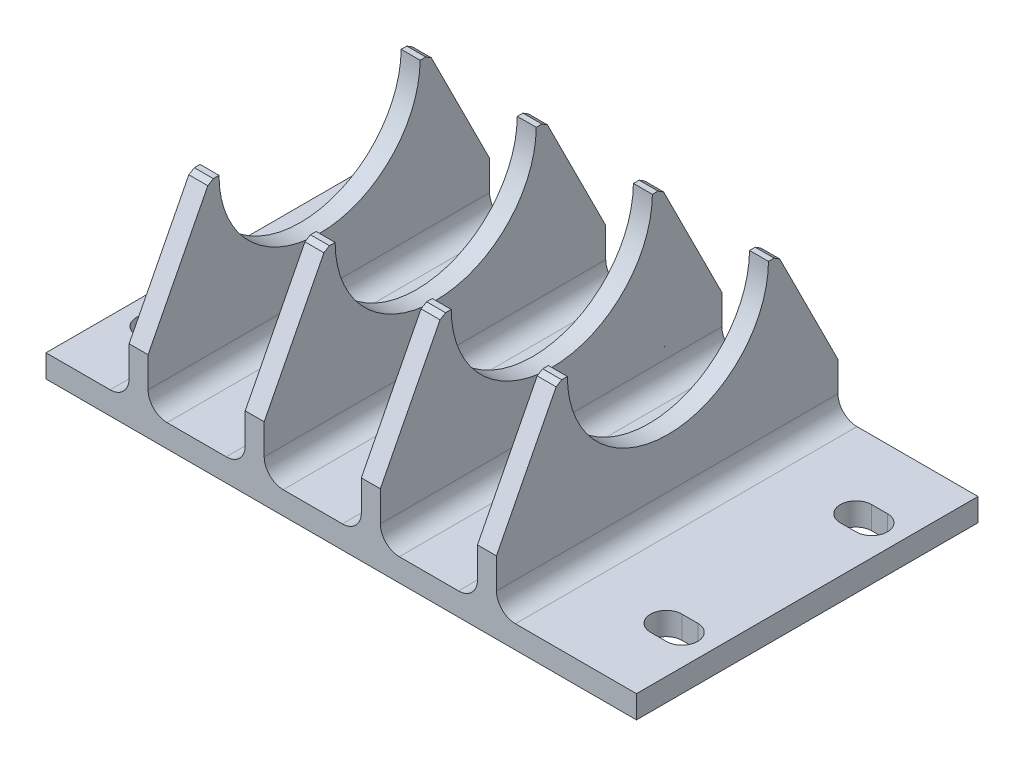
from build123d import *

# Parameters (mm, degrees)
SKETCH1_W           = 155.6
SKETCH1_H           = 90
SKETCH1_R           = 4.15
BOSS_EXTRUDE1_DEPTH = 6
SKETCH4_W           = 5
SKETCH4_H           = 50
BOSS_EXTRUDE2_DEPTH = 90
LPATTERN1_COUNT     = 4
LPATTERN1_PITCH     = 30.6
CUT_EXTRUDE3_DEPTH  = 160
FILLET1_R           = 5
CUT_EXTRUDE4_START  = -10
CUT_EXTRUDE4_DEPTH  = 10
CUT_EXTRUDE5_DEPTH  = 1
CUT_EXTRUDE6_DEPTH  = 1


with BuildPart() as part:
    # Sketch1 → Boss-Extrude1 (new body)
    with BuildSketch(Plane(origin=(0, 0, 0), x_dir=(1, 0, 0), z_dir=(0, 1, 0))):
        Rectangle(SKETCH1_W, SKETCH1_H)
        with Locations(Location((-69.8, 25, 0), (0, 0, 270))):
            Circle(SKETCH1_R, mode=Mode.SUBTRACT)
        with Locations(Location((-69.8, -25, 0), (0, 0, 270))):
            Circle(SKETCH1_R, mode=Mode.SUBTRACT)
        with Locations(Location((69.8, 25, 0), (0, 0, 270))):
            Circle(SKETCH1_R, mode=Mode.SUBTRACT)
        with Locations(Location((69.8, -25, 0), (0, 0, 270))):
            Circle(SKETCH1_R, mode=Mode.SUBTRACT)
    extrude(amount=BOSS_EXTRUDE1_DEPTH)

    # Sketch4 → Boss-Extrude2 (add)
    with BuildSketch(Plane.XY.offset(45)):
        with Locations((38.4, 31)):
            Rectangle(SKETCH4_W, SKETCH4_H)
    boss_extrude2 = extrude(amount=-BOSS_EXTRUDE2_DEPTH)

    # LPattern1: Boss-Extrude2 ×4
    with Locations(*[(-i * LPATTERN1_PITCH, 0, 0) for i in range(1, LPATTERN1_COUNT)]):
        add(boss_extrude2)

    # Sketch5 → Cut-Extrude3 (cut)
    with BuildSketch(Plane.ZY.offset(55.9)):
        with BuildLine():
            Line((26.30668885, 50.587354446), (27.80668885, 50.587354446))
            Line((27.80668885, 50.587354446), (29.262886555, 49.697475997))
            Line((29.262886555, 49.697475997), (45, 19))
            Line((45, 19), (60.820382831, 19))
            Line((60.820382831, 19), (60.820382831, 68.743316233))
            Line((60.820382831, 68.743316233), (-54.748505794, 68.743316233))
            Line((-54.748505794, 68.743316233), (-54.748505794, 18.60931822))
            Line((-54.748505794, 18.60931822), (-45.111030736, 18.60931822))
            Line((-45.111030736, 18.60931822), (-29.640685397, 49.442096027))
            Line((-29.640685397, 49.442096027), (-28.192258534, 50.34456765))
            Line((-28.192258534, 50.34456765), (-26.692314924, 50.357574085))
            ThreePointArc((-26.692314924, 50.357574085), (-0.07841989, 24.087603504), (26.30668885, 50.587354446))
        make_face()
    extrude(amount=-CUT_EXTRUDE3_DEPTH, mode=Mode.SUBTRACT)

    # Fillet1
    fillet1_edges = [part.edges().sort_by_distance(p)[0] for p in [
        (40.9, 6, 0),
        (10.3, 6, 0),
        (-20.3, 6, 0),
        (-50.9, 6, 0),
        (35.9, 6, 0),
        (5.3, 6, 0),
        (-25.3, 6, 0),
        (-55.9, 6, 0),
    ]]
    fillet(fillet1_edges, radius=FILLET1_R)

    # Sketch6 → Cut-Extrude4 (cut)
    with BuildSketch(Plane(origin=(0, 6, 0), x_dir=(1, 0, 0), z_dir=(0, 1, 0)).offset(CUT_EXTRUDE4_START)):
        with BuildLine():
            Line((-69.8, 29.15), (-65.65, 29.15))
            ThreePointArc((-65.65, 29.15), (-61.5, 25), (-65.65, 20.85))
            Line((-65.65, 20.85), (-69.8, 20.85))
            ThreePointArc((-69.8, 20.85), (-73.95, 25), (-69.8, 29.15))
        make_face()
        with BuildLine():
            Line((-69.8, -20.85), (-65.65, -20.85))
            ThreePointArc((-65.65, -20.85), (-61.5, -25), (-65.65, -29.15))
            Line((-65.65, -29.15), (-69.8, -29.15))
            ThreePointArc((-69.8, -29.15), (-73.95, -25), (-69.8, -20.85))
        make_face()
        with BuildLine():
            Line((69.8, 20.85), (65.65, 20.85))
            ThreePointArc((65.65, 20.85), (61.5, 25), (65.65, 29.15))
            Line((65.65, 29.15), (69.8, 29.15))
            ThreePointArc((69.8, 29.15), (73.95, 25), (69.8, 20.85))
        make_face()
        with BuildLine():
            Line((69.8, -29.15), (65.65, -29.15))
            ThreePointArc((65.65, -29.15), (61.5, -25), (65.65, -20.85))
            Line((65.65, -20.85), (69.8, -20.85))
            ThreePointArc((69.8, -20.85), (73.95, -25), (69.8, -29.15))
        make_face()
    extrude(amount=CUT_EXTRUDE4_DEPTH, mode=Mode.SUBTRACT)

    # Sketch7 → Cut-Extrude5 (cut)
    with BuildSketch(Plane(origin=(0, 0, 0), x_dir=(-1, 0, 0), z_dir=(0, -1, 0))):
        with BuildLine():
            ThreePointArc((66.302470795, -10.211702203), (0, -29.024730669), (-66.302470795, -10.211702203))
            ThreePointArc((-66.302470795, -10.211702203), (-72, 0), (-66.302470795, 10.211702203))
            ThreePointArc((-66.302470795, 10.211702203), (0, 29.024730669), (66.302470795, 10.211702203))
            ThreePointArc((66.302470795, 10.211702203), (72, 0), (66.302470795, -10.211702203))
        make_face()
        with BuildLine():
            ThreePointArc((65.252058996, -8.509751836), (70, 0), (65.252058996, 8.509751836))
            ThreePointArc((65.252058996, 8.509751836), (0, 27.024730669), (-65.252058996, 8.509751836))
            ThreePointArc((-65.252058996, 8.509751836), (-70, 0), (-65.252058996, -8.509751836))
            ThreePointArc((-65.252058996, -8.509751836), (0, -27.024730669), (65.252058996, -8.509751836))
        make_face(mode=Mode.SUBTRACT)
    extrude(amount=-CUT_EXTRUDE5_DEPTH, mode=Mode.SUBTRACT)

    # Sketch9 → Cut-Extrude6 (cut)
    # profile 1 of 10: a face of its own
    with BuildSketch(Plane.XZ):
        with BuildLine():
            Line((-42.683079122, 8.459761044), (-44.412386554, 5.824625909))
            Line((-44.412386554, 5.824625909), (-48.390427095, 5.824625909))
            Line((-48.390427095, 5.824625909), (-49.974041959, 0.757058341))
            Line((-49.974041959, 0.757058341), (-46.33172777, 0.757058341))
            add(Edge.make_bspline(
                [(-46.33172777, 0.757058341), (-46.349100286, 0.632471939), (-46.382432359, 0.393432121), (-46.507803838, 0.063329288), (-46.692489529, -0.216232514), (-46.933473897, -0.446985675), (-47.231942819, -0.626617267), (-47.587694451, -0.75063428), (-47.996322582, -0.830371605), (-48.287609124, -0.84031842), (-48.44110277, -0.845559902)],
                knots=[0, 0, 0, 0, 1.017887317, 1.952986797, 2.836476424, 3.714638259, 4.636907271, 5.639186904, 6.755967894, 8, 8, 8, 8], degree=3))
            Line((-48.44110277, -0.845559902), (-50.518805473, -0.86456328))
            Line((-50.518805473, -0.86456328), (-51.263104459, -3.407848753))
            add(Edge.make_bspline(
                [(-51.263104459, -3.407848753), (-51.310952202, -3.535257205), (-51.404802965, -3.785162), (-51.573175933, -4.141046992), (-51.762287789, -4.469801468), (-51.959245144, -4.78110071), (-52.183126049, -5.060331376), (-52.416970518, -5.32204376), (-52.675725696, -5.550354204), (-52.944879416, -5.762880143), (-53.234874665, -5.946748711), (-53.542531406, -6.105131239), (-53.868276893, -6.238217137), (-54.209939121, -6.349652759), (-54.569445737, -6.433566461), (-54.944525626, -6.499083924), (-55.338729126, -6.532167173), (-55.607437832, -6.537509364), (-55.744734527, -6.540238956)],
                knots=[0, 0, 0, 0, 1.109261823, 2.17575713, 3.204921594, 4.200459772, 5.175052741, 6.119377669, 7.057918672, 7.984183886, 8.913004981, 9.85229557, 10.801745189, 11.778919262, 12.778912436, 13.809048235, 14.880533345, 16, 16, 16, 16], degree=3))
            Line((-55.744734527, -6.540238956), (-63.358754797, -6.540238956))
            add(Edge.make_bspline(
                [(-63.358754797, -6.540238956), (-63.280946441, -6.365400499), (-63.136326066, -6.040432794), (-62.915778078, -5.598450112), (-62.709120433, -5.238039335), (-62.565070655, -5.032854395), (-62.500435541, -4.940787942)],
                knots=[0, 0, 0, 0, 1.262492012, 2.346561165, 3.258102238, 4, 4, 4, 4], degree=3))
            add(Edge.make_bspline(
                [(-62.500435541, -4.940787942), (-62.446846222, -4.874179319), (-62.343148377, -4.745288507), (-62.169826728, -4.575570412), (-61.989128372, -4.432481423), (-61.801936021, -4.315077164), (-61.609284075, -4.220832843), (-61.408357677, -4.15337774), (-61.199097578, -4.115377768), (-61.057378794, -4.110330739), (-60.98649973, -4.107806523)],
                knots=[0, 0, 0, 0, 1.143544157, 2.212811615, 3.239098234, 4.223266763, 5.165024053, 6.103488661, 7.051481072, 8, 8, 8, 8], degree=3))
            add(Edge.make_bspline(
                [(-60.98649973, -4.107806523), (-60.941062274, -4.108139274), (-60.847899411, -4.108821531), (-60.755247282, -4.118622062), (-60.707783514, -4.123642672)],
                knots=[0, 0, 0, 0, 0.975441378, 2, 2, 2, 2], degree=3))
            Line((-60.707783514, -4.123642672), (-55.510359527, -4.766590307))
            Line((-55.510359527, -4.766590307), (-52.216440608, 5.824625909))
            Line((-52.216440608, 5.824625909), (-58.161330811, 5.824625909))
            add(Edge.make_bspline(
                [(-58.161330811, 5.824625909), (-58.271227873, 5.822184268), (-58.489571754, 5.817333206), (-58.812805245, 5.778714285), (-59.127693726, 5.71377203), (-59.436395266, 5.630736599), (-59.733530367, 5.513982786), (-60.024549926, 5.37909704), (-60.303355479, 5.212366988), (-60.481582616, 5.086754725), (-60.571592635, 5.023316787)],
                knots=[0, 0, 0, 0, 1.020009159, 2.026557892, 3.01641184, 4.003204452, 4.989705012, 5.976108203, 6.977874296, 8, 8, 8, 8], degree=3))
            add(Edge.make_bspline(
                [(-60.571592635, 5.023316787), (-60.663970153, 4.950208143), (-60.844794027, 4.807102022), (-61.083858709, 4.565478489), (-61.282645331, 4.307331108), (-61.452802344, 4.039258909), (-61.576960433, 3.752924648), (-61.671724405, 3.4552445), (-61.725781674, 3.141827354), (-61.733303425, 2.927865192), (-61.737133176, 2.818924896)],
                knots=[0, 0, 0, 0, 1.090341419, 2.134282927, 3.137555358, 4.103449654, 5.066370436, 6.018810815, 6.991263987, 8, 8, 8, 8], degree=3))
            add(Edge.make_bspline(
                [(-61.737133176, 2.818924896), (-61.736106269, 2.746032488), (-61.734182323, 2.609465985), (-61.7152719, 2.416633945), (-61.684142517, 2.247956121), (-61.642140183, 2.102265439), (-61.583952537, 1.981364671), (-61.514711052, 1.88436071), (-61.430635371, 1.810115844), (-61.364383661, 1.783627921), (-61.33172777, 1.770571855)],
                knots=[0, 0, 0, 0, 1.465351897, 2.745388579, 3.890327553, 4.911042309, 5.784494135, 6.57422393, 7.297225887, 8, 8, 8, 8], degree=3))
            add(Edge.make_bspline(
                [(-61.33172777, 1.770571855), (-61.313318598, 1.846025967), (-61.276674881, 1.996218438), (-61.192904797, 2.211083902), (-61.090781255, 2.415525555), (-60.970456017, 2.608900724), (-60.830618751, 2.791620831), (-60.666643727, 2.958589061), (-60.486818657, 3.119593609), (-60.352059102, 3.212047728), (-60.28337473, 3.259169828)],
                knots=[0, 0, 0, 0, 0.996723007, 1.98399116, 2.954349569, 3.92896292, 4.905461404, 5.902922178, 6.931159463, 8, 8, 8, 8], degree=3))
            add(Edge.make_bspline(
                [(-60.28337473, 3.259169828), (-60.148324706, 3.34150474), (-59.878644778, 3.505918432), (-59.431897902, 3.678079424), (-58.955361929, 3.776570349), (-58.628427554, 3.790511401), (-58.462217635, 3.797598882)],
                knots=[0, 0, 0, 0, 0.983662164, 1.964264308, 2.965053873, 4, 4, 4, 4], degree=3))
            add(Edge.make_bspline(
                [(-58.462217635, 3.797598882), (-58.370268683, 3.796110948), (-58.190016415, 3.793194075), (-57.924043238, 3.760112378), (-57.668746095, 3.706887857), (-57.422451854, 3.632385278), (-57.183192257, 3.542401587), (-56.956501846, 3.423922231), (-56.738612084, 3.286680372), (-56.602275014, 3.182143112), (-56.53337473, 3.129313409)],
                knots=[0, 0, 0, 0, 1.058707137, 2.075438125, 3.082007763, 4.059352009, 5.037301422, 6.021808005, 7.000286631, 8, 8, 8, 8], degree=3))
            add(Edge.make_bspline(
                [(-56.53337473, 3.129313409), (-56.463311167, 3.069606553), (-56.326054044, 2.952638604), (-56.14710018, 2.753122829), (-55.995533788, 2.541623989), (-55.868896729, 2.317274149), (-55.775090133, 2.077875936), (-55.704471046, 1.826688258), (-55.662350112, 1.561901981), (-55.658176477, 1.38115382), (-55.656052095, 1.289152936)],
                knots=[0, 0, 0, 0, 1.044700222, 2.046606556, 3.035000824, 3.995950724, 4.964651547, 5.948086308, 6.955575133, 8, 8, 8, 8], degree=3))
            add(Edge.make_bspline(
                [(-55.656052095, 1.289152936), (-55.659076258, 1.187644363), (-55.665001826, 0.988747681), (-55.711945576, 0.698655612), (-55.796753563, 0.427614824), (-55.906712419, 0.17048277), (-56.054078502, -0.067427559), (-56.232923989, -0.288771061), (-56.447193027, -0.488387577), (-56.607077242, -0.605391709), (-56.688568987, -0.665027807)],
                knots=[0, 0, 0, 0, 1.054946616, 2.067070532, 3.042536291, 4.000812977, 4.966351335, 5.94157014, 6.950834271, 8, 8, 8, 8], degree=3))
            add(Edge.make_bspline(
                [(-56.688568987, -0.665027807), (-56.763811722, -0.713804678), (-56.914755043, -0.811655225), (-57.156942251, -0.936394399), (-57.414264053, -1.034941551), (-57.682006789, -1.122914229), (-57.965033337, -1.188730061), (-58.261437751, -1.235317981), (-58.571417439, -1.264912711), (-58.78203944, -1.268257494), (-58.889793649, -1.269968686)],
                knots=[0, 0, 0, 0, 0.928253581, 1.862155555, 2.814308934, 3.778933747, 4.778667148, 5.819347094, 6.884378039, 8, 8, 8, 8], degree=3))
            add(Edge.make_bspline(
                [(-58.889793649, -1.269968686), (-59.05564006, -1.266768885), (-59.380546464, -1.260500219), (-59.857978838, -1.215965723), (-60.313073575, -1.140493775), (-60.746988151, -1.035293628), (-61.160650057, -0.902750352), (-61.553439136, -0.738888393), (-61.923937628, -0.541400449), (-62.154308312, -0.387213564), (-62.26922777, -0.310298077)],
                knots=[0, 0, 0, 0, 1.114834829, 2.184050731, 3.220153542, 4.213389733, 5.182990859, 6.137301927, 7.070800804, 8, 8, 8, 8], degree=3))
            add(Edge.make_bspline(
                [(-62.26922777, -0.310298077), (-62.389058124, -0.219364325), (-62.623242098, -0.041652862), (-62.924844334, 0.272516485), (-63.188700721, 0.603320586), (-63.397635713, 0.966622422), (-63.565400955, 1.350362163), (-63.676594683, 1.762629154), (-63.754225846, 2.197331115), (-63.760800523, 2.49761549), (-63.764160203, 2.65106172)],
                knots=[0, 0, 0, 0, 1.043366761, 2.039047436, 3.016053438, 3.975731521, 4.941554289, 5.916659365, 6.935406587, 8, 8, 8, 8], degree=3))
            add(Edge.make_bspline(
                [(-63.764160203, 2.65106172), (-63.757714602, 2.880554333), (-63.745109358, 3.329358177), (-63.639374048, 3.982717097), (-63.461397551, 4.596476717), (-63.212010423, 5.170305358), (-62.896838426, 5.70867973), (-62.505493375, 6.2053471), (-62.045454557, 6.664859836), (-61.694105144, 6.928791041), (-61.515427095, 7.063012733)],
                knots=[0, 0, 0, 0, 1.0664305, 2.085549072, 3.067173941, 4.030017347, 4.987101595, 5.959108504, 6.962108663, 8, 8, 8, 8], degree=3))
            add(Edge.make_bspline(
                [(-61.515427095, 7.063012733), (-61.347313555, 7.174827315), (-61.00923058, 7.399690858), (-60.465229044, 7.682622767), (-59.892588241, 7.925191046), (-59.289311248, 8.12062251), (-58.656140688, 8.273456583), (-57.993063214, 8.378509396), (-57.30026221, 8.447993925), (-56.828101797, 8.455785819), (-56.587217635, 8.459761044)],
                knots=[0, 0, 0, 0, 0.930526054, 1.871324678, 2.822583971, 3.795621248, 4.79225737, 5.823170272, 6.889437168, 8, 8, 8, 8], degree=3))
            Line((-56.587217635, 8.459761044), (-42.683079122, 8.459761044))
        make_face()
    # profile 2 of 10: a face of its own
    with BuildSketch(Plane.XZ):
        with BuildLine():
            add(Edge.make_bspline(
                [(-38.629025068, 5.121500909), (-38.631516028, 5.034824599), (-38.636431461, 4.863785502), (-38.673670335, 4.612340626), (-38.743638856, 4.372899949), (-38.829187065, 4.140094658), (-38.950663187, 3.920417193), (-39.091264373, 3.706560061), (-39.265277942, 3.508328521), (-39.456997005, 3.318854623), (-39.666600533, 3.144894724), (-39.894137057, 2.997742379), (-40.126414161, 2.864508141), (-40.374099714, 2.765729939), (-40.6278954, 2.680062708), (-40.894937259, 2.625351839), (-41.172359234, 2.588837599), (-41.361165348, 2.583898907), (-41.457361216, 2.581382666)],
                knots=[0, 0, 0, 0, 0.984503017, 1.942728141, 2.87670971, 3.81430259, 4.753198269, 5.721054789, 6.716091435, 7.742150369, 8.781646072, 9.802717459, 10.817218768, 11.817157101, 12.825901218, 13.856086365, 14.907685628, 16, 16, 16, 16], degree=3))
            add(Edge.make_bspline(
                [(-41.457361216, 2.581382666), (-41.554608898, 2.583908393), (-41.74551152, 2.588866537), (-42.026126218, 2.625259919), (-42.297168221, 2.680604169), (-42.555522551, 2.765156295), (-42.806566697, 2.863799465), (-43.03955915, 2.997803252), (-43.267139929, 3.144874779), (-43.476700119, 3.318872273), (-43.66854515, 3.508279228), (-43.842116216, 3.706732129), (-43.984022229, 3.919390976), (-44.099827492, 4.141762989), (-44.191204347, 4.372019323), (-44.259720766, 4.61248039), (-44.297381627, 4.863749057), (-44.302239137, 5.034812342), (-44.304700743, 5.121500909)],
                knots=[0, 0, 0, 0, 1.099602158, 2.15858036, 3.196066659, 4.223263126, 5.229989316, 6.240179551, 7.256911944, 8.291990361, 9.313689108, 10.304497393, 11.268241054, 12.197563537, 13.135514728, 14.065527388, 15.019680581, 16, 16, 16, 16], degree=3))
            add(Edge.make_bspline(
                [(-44.304700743, 5.121500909), (-44.302273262, 5.207145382), (-44.297483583, 5.376131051), (-44.259185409, 5.625122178), (-44.191972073, 5.863904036), (-44.09885276, 6.092363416), (-43.985074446, 6.313739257), (-43.84098026, 6.523893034), (-43.668700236, 6.722151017), (-43.476666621, 6.911457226), (-43.267114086, 7.085371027), (-43.039692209, 7.23287282), (-42.805710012, 7.365456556), (-42.556940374, 7.470141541), (-42.296417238, 7.548459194), (-42.026247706, 7.605438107), (-41.745479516, 7.641370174), (-41.554598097, 7.646392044), (-41.457361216, 7.648950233)],
                knots=[0, 0, 0, 0, 0.971042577, 1.915970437, 2.848527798, 3.777928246, 4.709793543, 5.666257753, 6.65977709, 7.68427141, 8.72218201, 9.741696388, 10.754650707, 11.76873666, 12.795188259, 13.835513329, 14.897389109, 16, 16, 16, 16], degree=3))
            add(Edge.make_bspline(
                [(-41.457361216, 7.648950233), (-41.36117646, 7.646401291), (-41.172392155, 7.641398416), (-40.894812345, 7.605348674), (-40.628663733, 7.548999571), (-40.372664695, 7.469547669), (-40.127288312, 7.364734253), (-39.893999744, 7.232939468), (-39.666627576, 7.085349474), (-39.457030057, 6.911475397), (-39.265123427, 6.722101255), (-39.09240003, 6.524065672), (-38.949597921, 6.312718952), (-38.830168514, 6.094038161), (-38.742877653, 5.863010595), (-38.67420685, 5.625262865), (-38.63632878, 5.376094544), (-38.631481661, 5.207133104), (-38.629025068, 5.121500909)],
                knots=[0, 0, 0, 0, 1.095321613, 2.149816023, 3.182837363, 4.190706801, 5.198073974, 6.215368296, 7.239250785, 8.281608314, 9.310492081, 10.308268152, 11.268830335, 12.210310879, 13.139267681, 14.075820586, 15.02479699, 16, 16, 16, 16], degree=3))
        make_face()
    # profile 3 of 10: a face of its own
    with BuildSketch(Plane.XZ):
        with BuildLine():
            add(Edge.make_bspline(
                [(-37.615511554, -4.918617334), (-37.640757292, -4.990835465), (-37.690632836, -5.13350979), (-37.784755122, -5.3381605), (-37.903436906, -5.524447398), (-38.037627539, -5.697775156), (-38.189840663, -5.856747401), (-38.362140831, -5.999799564), (-38.553747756, -6.127407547), (-38.691657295, -6.199425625), (-38.762048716, -6.236184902)],
                knots=[0, 0, 0, 0, 1.020280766, 2.015669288, 2.996405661, 3.959800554, 4.935874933, 5.925769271, 6.941276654, 8, 8, 8, 8], degree=3))
            add(Edge.make_bspline(
                [(-38.762048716, -6.236184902), (-38.867681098, -6.283200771), (-39.078769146, -6.377153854), (-39.41554359, -6.470634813), (-39.765006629, -6.529725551), (-40.003358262, -6.536706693), (-40.1239575, -6.540238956)],
                knots=[0, 0, 0, 0, 0.984987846, 1.968327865, 2.97203091, 4, 4, 4, 4], degree=3))
            Line((-40.1239575, -6.540238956), (-44.320536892, -6.540238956))
            add(Edge.make_bspline(
                [(-44.320536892, -6.540238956), (-44.439020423, -6.537204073), (-44.662956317, -6.531468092), (-44.976232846, -6.473307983), (-45.242258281, -6.370704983), (-45.465201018, -6.232098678), (-45.635056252, -6.043235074), (-45.757789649, -5.816896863), (-45.826841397, -5.5485714), (-45.835975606, -5.358205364), (-45.840807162, -5.257510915)],
                knots=[0, 0, 0, 0, 1.249625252, 2.361813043, 3.342508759, 4.24489277, 5.104514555, 5.991917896, 6.937821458, 8, 8, 8, 8], degree=3))
            add(Edge.make_bspline(
                [(-45.840807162, -5.257510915), (-45.833106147, -5.130949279), (-45.816923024, -4.864989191), (-45.734925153, -4.611325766), (-45.691947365, -4.478372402)],
                knots=[0, 0, 0, 0, 0.951734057, 2, 2, 2, 2], degree=3))
            Line((-45.691947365, -4.478372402), (-44.060824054, 0.757058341))
            Line((-44.060824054, 0.757058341), (-40.234810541, 0.757058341))
            Line((-40.234810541, 0.757058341), (-41.992623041, -4.918617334))
            Line((-41.992623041, -4.918617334), (-37.615511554, -4.918617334))
        make_face()
    # profile 4 of 10: a face of its own
    with BuildSketch(Plane.XZ):
        with BuildLine():
            add(Edge.make_bspline(
                [(-29.507403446, -4.918617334), (-29.530814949, -4.991176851), (-29.577457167, -5.135735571), (-29.681026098, -5.337279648), (-29.801405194, -5.525481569), (-29.942703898, -5.699830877), (-30.107741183, -5.856710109), (-30.292849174, -6.000865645), (-30.500646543, -6.128074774), (-30.650080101, -6.199513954), (-30.726786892, -6.236184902)],
                knots=[0, 0, 0, 0, 0.984671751, 1.961739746, 2.92002085, 3.871173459, 4.856223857, 5.858630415, 6.900798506, 8, 8, 8, 8], degree=3))
            add(Edge.make_bspline(
                [(-30.726786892, -6.236184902), (-30.838802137, -6.28322722), (-31.062866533, -6.377326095), (-31.41752484, -6.470224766), (-31.7836639, -6.529779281), (-32.032502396, -6.536725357), (-32.15837473, -6.540238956)],
                knots=[0, 0, 0, 0, 0.987775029, 1.975849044, 2.976104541, 4, 4, 4, 4], degree=3))
            Line((-32.15837473, -6.540238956), (-36.237766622, -6.540238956))
            add(Edge.make_bspline(
                [(-36.237766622, -6.540238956), (-36.360403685, -6.537800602), (-36.591050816, -6.533214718), (-36.913345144, -6.484305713), (-37.187076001, -6.399159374), (-37.415533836, -6.283736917), (-37.593541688, -6.1267864), (-37.720556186, -5.934734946), (-37.795578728, -5.707233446), (-37.804190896, -5.545256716), (-37.808712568, -5.460213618)],
                knots=[0, 0, 0, 0, 1.360301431, 2.55835891, 3.603240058, 4.530866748, 5.377332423, 6.20593436, 7.058056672, 8, 8, 8, 8], degree=3))
            add(Edge.make_bspline(
                [(-37.808712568, -5.460213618), (-37.802973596, -5.360296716), (-37.790630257, -5.145396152), (-37.726068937, -4.939891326), (-37.691525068, -4.829934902)],
                knots=[0, 0, 0, 0, 0.929889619, 2, 2, 2, 2], degree=3))
            Line((-37.691525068, -4.829934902), (-34.188568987, 6.432734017))
            Line((-34.188568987, 6.432734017), (-30.479742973, 6.432734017))
            Line((-30.479742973, 6.432734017), (-33.985866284, -4.918617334))
            Line((-33.985866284, -4.918617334), (-29.507403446, -4.918617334))
        make_face()
    # profile 5 of 10: a face of its own
    with BuildSketch(Plane.XZ):
        with BuildLine():
            add(Edge.make_bspline(
                [(-15.723619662, -4.918617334), (-15.769736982, -5.047387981), (-15.859427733, -5.297826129), (-16.067375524, -5.631358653), (-16.320703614, -5.916636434), (-16.627937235, -6.147798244), (-16.984756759, -6.325465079), (-17.389919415, -6.451417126), (-17.842826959, -6.527333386), (-18.161019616, -6.535813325), (-18.3270825, -6.540238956)],
                knots=[0, 0, 0, 0, 0.98795357, 1.921410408, 2.825387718, 3.736575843, 4.686937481, 5.697463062, 6.798319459, 8, 8, 8, 8], degree=3))
            Line((-18.3270825, -6.540238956), (-22.352631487, -6.540238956))
            add(Edge.make_bspline(
                [(-22.352631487, -6.540238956), (-22.48688857, -6.537612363), (-22.739463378, -6.532671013), (-23.091117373, -6.486239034), (-23.392086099, -6.410948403), (-23.636752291, -6.295051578), (-23.836785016, -6.153823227), (-23.972291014, -5.968222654), (-24.062095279, -5.75402826), (-24.068890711, -5.598430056), (-24.07243723, -5.517223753)],
                knots=[0, 0, 0, 0, 1.430218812, 2.69063824, 3.7743056, 4.720615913, 5.564579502, 6.352278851, 7.140058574, 8, 8, 8, 8], degree=3))
            add(Edge.make_bspline(
                [(-24.07243723, -5.517223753), (-24.169580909, -5.615625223), (-24.36030702, -5.808820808), (-24.678806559, -6.055162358), (-25.007706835, -6.271670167), (-25.35962017, -6.440784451), (-25.724204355, -6.580013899), (-26.107320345, -6.673382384), (-26.506170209, -6.732703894), (-26.77808945, -6.739486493), (-26.916609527, -6.742941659)],
                knots=[0, 0, 0, 0, 1.039362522, 2.040622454, 3.023433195, 3.996920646, 4.972286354, 5.954936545, 6.958211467, 8, 8, 8, 8], degree=3))
            add(Edge.make_bspline(
                [(-26.916609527, -6.742941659), (-27.018060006, -6.74035701), (-27.216293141, -6.735306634), (-27.506877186, -6.700194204), (-27.78298592, -6.640876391), (-28.04350016, -6.554426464), (-28.290290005, -6.44646876), (-28.521311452, -6.31299794), (-28.738981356, -6.156159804), (-28.940320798, -5.977435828), (-29.120746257, -5.776913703), (-29.280459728, -5.561444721), (-29.41347054, -5.329346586), (-29.521635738, -5.082701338), (-29.608028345, -4.822147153), (-29.667362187, -4.546049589), (-29.702470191, -4.25546246), (-29.707521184, -4.057229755), (-29.710106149, -3.955779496)],
                knots=[0, 0, 0, 0, 1.096591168, 2.142727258, 3.159054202, 4.144340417, 5.104993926, 6.06618964, 7.022766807, 8.000888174, 8.970516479, 9.93381036, 10.895006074, 11.855659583, 12.840945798, 13.857272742, 14.903408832, 16, 16, 16, 16], degree=3))
            add(Edge.make_bspline(
                [(-29.710106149, -3.955779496), (-29.705763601, -3.773875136), (-29.697262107, -3.417757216), (-29.615414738, -2.899650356), (-29.486322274, -2.409190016), (-29.30202563, -1.950422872), (-29.068461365, -1.518149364), (-28.778230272, -1.119645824), (-28.437578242, -0.747755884), (-28.176701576, -0.531192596), (-28.044143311, -0.421151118)],
                knots=[0, 0, 0, 0, 1.075724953, 2.10596894, 3.095555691, 4.071220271, 5.024546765, 5.995559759, 6.981491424, 8, 8, 8, 8], degree=3))
            add(Edge.make_bspline(
                [(-28.044143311, -0.421151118), (-27.915886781, -0.326922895), (-27.659435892, -0.138512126), (-27.245435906, 0.101623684), (-26.809980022, 0.305616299), (-26.351323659, 0.469570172), (-25.871909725, 0.600447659), (-25.36860131, 0.691752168), (-24.843258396, 0.745646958), (-24.485359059, 0.753215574), (-24.303645, 0.757058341)],
                knots=[0, 0, 0, 0, 0.95532143, 1.910179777, 2.869009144, 3.839819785, 4.831973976, 5.850583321, 6.908689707, 8, 8, 8, 8], degree=3))
            Line((-24.303645, 0.757058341), (-18.355587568, 0.757058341))
            Line((-18.355587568, 0.757058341), (-20.119734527, -4.918617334))
            Line((-20.119734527, -4.918617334), (-15.723619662, -4.918617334))
        make_face()
        with BuildLine():
            Line((-22.675688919, -0.86456328), (-25.047943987, -0.86456328))
            Line((-25.047943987, -0.86456328), (-25.795410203, -3.430019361))
            add(Edge.make_bspline(
                [(-25.795410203, -3.430019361), (-25.813866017, -3.506721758), (-25.848713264, -3.651546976), (-25.855542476, -3.80029586), (-25.858754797, -3.870264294)],
                knots=[0, 0, 0, 0, 1.059240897, 2, 2, 2, 2], degree=3))
            add(Edge.make_bspline(
                [(-25.858754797, -3.870264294), (-25.852899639, -3.946268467), (-25.841455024, -4.094827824), (-25.743121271, -4.300352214), (-25.583164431, -4.470346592), (-25.361233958, -4.603725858), (-25.081476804, -4.705149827), (-24.742974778, -4.779497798), (-24.344801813, -4.821408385), (-24.059870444, -4.826967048), (-23.907741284, -4.829934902)],
                knots=[0, 0, 0, 0, 0.753168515, 1.472159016, 2.215521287, 3.046160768, 4.023571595, 5.165213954, 6.486464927, 8, 8, 8, 8], degree=3))
            Line((-23.907741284, -4.829934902), (-22.675688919, -0.86456328))
        make_face(mode=Mode.SUBTRACT)
    # profile 6 of 10: a face of its own
    with BuildSketch(Plane.XZ):
        with BuildLine():
            add(Edge.make_bspline(
                [(9.006110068, -4.918617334), (8.964139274, -5.047786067), (8.881830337, -5.301098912), (8.664459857, -5.635187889), (8.390070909, -5.921789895), (8.045635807, -6.151624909), (7.638388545, -6.327201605), (7.169044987, -6.452606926), (6.637316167, -6.527588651), (6.261438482, -6.535878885), (6.063753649, -6.540238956)],
                knots=[0, 0, 0, 0, 0.893188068, 1.751631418, 2.604312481, 3.497364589, 4.464694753, 5.519712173, 6.695545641, 8, 8, 8, 8], degree=3))
            Line((6.063753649, -6.540238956), (2.259910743, -6.540238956))
            add(Edge.make_bspline(
                [(2.259910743, -6.540238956), (2.120424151, -6.5375319), (1.859520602, -6.532468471), (1.495484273, -6.487509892), (1.186811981, -6.40639615), (0.93104111, -6.293552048), (0.727254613, -6.147202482), (0.581292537, -5.963499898), (0.494686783, -5.74384336), (0.484990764, -5.586642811), (0.479927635, -5.504554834)],
                knots=[0, 0, 0, 0, 1.447153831, 2.706837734, 3.796448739, 4.747554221, 5.593324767, 6.373548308, 7.150689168, 8, 8, 8, 8], degree=3))
            add(Edge.make_bspline(
                [(0.479927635, -5.504554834), (0.482297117, -5.438878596), (0.487426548, -5.296703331), (0.537630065, -5.072822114), (0.606325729, -4.820529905), (0.670595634, -4.646830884), (0.704800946, -4.554385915)],
                knots=[0, 0, 0, 0, 0.802173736, 1.736537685, 2.795354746, 4, 4, 4, 4], degree=3))
            Line((0.704800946, -4.554385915), (2.316920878, 0.053933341))
            Line((2.316920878, 0.053933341), (-3.187724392, -5.43487578))
            add(Edge.make_bspline(
                [(-3.187724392, -5.43487578), (-3.251651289, -5.538286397), (-3.373884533, -5.736015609), (-3.573677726, -6.004392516), (-3.77964488, -6.230319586), (-3.989338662, -6.417522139), (-4.205744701, -6.562157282), (-4.427975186, -6.664783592), (-4.654307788, -6.733333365), (-4.808876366, -6.739761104), (-4.885359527, -6.742941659)],
                knots=[0, 0, 0, 0, 1.301069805, 2.487747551, 3.57564923, 4.568655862, 5.490211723, 6.349809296, 7.183457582, 8, 8, 8, 8], degree=3))
            add(Edge.make_bspline(
                [(-4.885359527, -6.742941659), (-4.945615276, -6.74070136), (-5.069640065, -6.73609014), (-5.192668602, -6.719697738), (-5.255925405, -6.711269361)],
                knots=[0, 0, 0, 0, 0.971672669, 2, 2, 2, 2], degree=3))
            add(Edge.make_bspline(
                [(-5.255925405, -6.711269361), (-5.344122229, -6.696942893), (-5.51184384, -6.66969862), (-5.744054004, -6.590525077), (-5.942058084, -6.478999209), (-6.103644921, -6.333607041), (-6.229591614, -6.158570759), (-6.320255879, -5.954103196), (-6.368852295, -5.718991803), (-6.376359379, -5.553329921), (-6.380291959, -5.466548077)],
                knots=[0, 0, 0, 0, 1.144503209, 2.176472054, 3.128704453, 4.039508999, 4.941413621, 5.874882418, 6.886758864, 8, 8, 8, 8], degree=3))
            add(Edge.make_bspline(
                [(-6.380291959, -5.466548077), (-6.377476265, -5.394633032), (-6.371690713, -5.24686551), (-6.335192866, -5.020876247), (-6.275692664, -4.786205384), (-6.217153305, -4.630949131), (-6.187090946, -4.551218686)],
                knots=[0, 0, 0, 0, 0.917351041, 1.884928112, 2.91382396, 4, 4, 4, 4], degree=3))
            Line((-6.187090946, -4.551218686), (-4.080883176, 2.217151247))
            Line((-4.080883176, 2.217151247), (-10.494523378, -5.415872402))
            add(Edge.make_bspline(
                [(-10.494523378, -5.415872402), (-10.546222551, -5.504901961), (-10.646656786, -5.677856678), (-10.829147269, -5.907711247), (-11.029524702, -6.102306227), (-11.247143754, -6.263755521), (-11.48435833, -6.388303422), (-11.739176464, -6.477813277), (-12.012815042, -6.528405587), (-12.200400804, -6.536225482), (-12.296677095, -6.540238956)],
                knots=[0, 0, 0, 0, 1.101622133, 2.140084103, 3.131743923, 4.086212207, 5.03213455, 5.990613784, 6.968705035, 8, 8, 8, 8], degree=3))
            Line((-12.296677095, -6.540238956), (-14.304700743, -6.540238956))
            Line((-14.304700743, -6.540238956), (-10.459683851, 5.824625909))
            Line((-10.459683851, 5.824625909), (-15.926322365, 5.824625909))
            Line((-15.926322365, 5.824625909), (-14.387048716, 8.459761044))
            Line((-14.387048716, 8.459761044), (-7.577504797, 8.459761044))
            add(Edge.make_bspline(
                [(-7.577504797, 8.459761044), (-7.466522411, 8.456753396), (-7.258333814, 8.451111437), (-6.967917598, 8.409524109), (-6.721950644, 8.333264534), (-6.517959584, 8.229853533), (-6.355401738, 8.093968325), (-6.241076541, 7.922709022), (-6.172877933, 7.720374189), (-6.165566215, 7.57559415), (-6.161753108, 7.500090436)],
                knots=[0, 0, 0, 0, 1.374033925, 2.577509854, 3.61927917, 4.548899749, 5.39247498, 6.211802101, 7.067443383, 8, 8, 8, 8], degree=3))
            add(Edge.make_bspline(
                [(-6.161753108, 7.500090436), (-6.164524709, 7.435541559), (-6.170426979, 7.298081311), (-6.210987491, 7.083894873), (-6.275357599, 6.850110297), (-6.333658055, 6.690988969), (-6.364455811, 6.606931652)],
                knots=[0, 0, 0, 0, 0.841357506, 1.791715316, 2.833453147, 4, 4, 4, 4], degree=3))
            Line((-6.364455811, 6.606931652), (-8.457994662, -0.132933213))
            Line((-8.457994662, -0.132933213), (-3.751491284, 5.146838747))
            add(Edge.make_bspline(
                [(-3.751491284, 5.146838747), (-3.688345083, 5.221969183), (-3.56691699, 5.36644257), (-3.388895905, 5.571720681), (-3.226027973, 5.761230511), (-3.067162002, 5.922570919), (-2.925454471, 6.068249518), (-2.791257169, 6.187436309), (-2.671515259, 6.291115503), (-2.591621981, 6.348773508), (-2.554278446, 6.375723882)],
                knots=[0, 0, 0, 0, 1.369292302, 2.633104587, 3.791572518, 4.854204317, 5.79164042, 6.625957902, 7.357748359, 8, 8, 8, 8], degree=3))
            add(Edge.make_bspline(
                [(-2.554278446, 6.375723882), (-2.431834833, 6.447784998), (-2.180163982, 6.595899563), (-1.747486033, 6.737419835), (-1.267683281, 6.823729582), (-0.930961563, 6.833199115), (-0.755291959, 6.838139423)],
                knots=[0, 0, 0, 0, 0.90309895, 1.856231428, 2.881583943, 4, 4, 4, 4], degree=3))
            add(Edge.make_bspline(
                [(-0.755291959, 6.838139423), (-0.702274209, 6.834473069), (-0.5937261, 6.826966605), (-0.428747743, 6.783581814), (-0.261209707, 6.710661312), (-0.15474646, 6.642295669), (-0.099675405, 6.606931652)],
                knots=[0, 0, 0, 0, 0.903088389, 1.848975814, 2.887323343, 4, 4, 4, 4], degree=3))
            add(Edge.make_bspline(
                [(-0.099675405, 6.606931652), (-0.015110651, 6.544830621), (0.150722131, 6.423049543), (0.324372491, 6.164343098), (0.430465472, 5.86535548), (0.442149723, 5.651385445), (0.448255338, 5.539575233)],
                knots=[0, 0, 0, 0, 0.998091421, 1.957272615, 2.93257119, 4, 4, 4, 4], degree=3))
            add(Edge.make_bspline(
                [(0.448255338, 5.539575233), (0.444508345, 5.463421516), (0.436809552, 5.306951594), (0.394274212, 5.064129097), (0.316861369, 4.810740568), (0.248909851, 4.6396157), (0.213880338, 4.551399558)],
                knots=[0, 0, 0, 0, 0.894726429, 1.838357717, 2.885657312, 4, 4, 4, 4], degree=3))
            Line((0.213880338, 4.551399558), (-1.496423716, -0.946911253))
            Line((-1.496423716, -0.946911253), (2.88702223, 3.132480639))
            add(Edge.make_bspline(
                [(2.88702223, 3.132480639), (2.955526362, 3.199114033), (3.0855906, 3.325626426), (3.272109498, 3.503404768), (3.442483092, 3.659125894), (3.590714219, 3.798428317), (3.726086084, 3.911906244), (3.838800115, 4.008864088), (3.937187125, 4.081417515), (3.997546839, 4.121885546), (4.024057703, 4.139659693)],
                knots=[0, 0, 0, 0, 1.508135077, 2.863395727, 4.065967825, 5.150831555, 6.072453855, 6.853197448, 7.496307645, 8, 8, 8, 8], degree=3))
            add(Edge.make_bspline(
                [(4.024057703, 4.139659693), (4.113683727, 4.182869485), (4.304812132, 4.275014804), (4.635740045, 4.354874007), (5.017110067, 4.401982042), (5.288658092, 4.404411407), (5.433474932, 4.40570699)],
                knots=[0, 0, 0, 0, 0.822041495, 1.753011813, 2.801678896, 4, 4, 4, 4], degree=3))
            add(Edge.make_bspline(
                [(5.433474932, 4.40570699), (5.496105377, 4.402772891), (5.624418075, 4.396761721), (5.817560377, 4.341418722), (6.014392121, 4.255804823), (6.140689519, 4.177275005), (6.206278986, 4.136492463)],
                knots=[0, 0, 0, 0, 0.904013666, 1.852077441, 2.884528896, 4, 4, 4, 4], degree=3))
            add(Edge.make_bspline(
                [(6.206278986, 4.136492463), (6.256787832, 4.101782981), (6.354740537, 4.034470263), (6.484896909, 3.915018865), (6.590379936, 3.781701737), (6.683126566, 3.640052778), (6.750970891, 3.484378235), (6.80343865, 3.31803735), (6.831248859, 3.138694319), (6.834754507, 3.015378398), (6.836557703, 2.951948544)],
                knots=[0, 0, 0, 0, 1.046144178, 2.028806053, 3.003325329, 3.943878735, 4.912539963, 5.893711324, 6.916590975, 8, 8, 8, 8], degree=3))
            add(Edge.make_bspline(
                [(6.836557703, 2.951948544), (6.834220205, 2.875749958), (6.829383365, 2.718076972), (6.784221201, 2.476700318), (6.718427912, 2.222320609), (6.656452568, 2.051992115), (6.624353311, 1.963772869)],
                knots=[0, 0, 0, 0, 0.899167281, 1.860590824, 2.891923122, 4, 4, 4, 4], degree=3))
            Line((6.624353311, 1.963772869), (4.214091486, -4.918617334))
            Line((4.214091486, -4.918617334), (9.006110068, -4.918617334))
        make_face()
    # profile 7 of 10: a face of its own
    with BuildSketch(Plane.XZ):
        with BuildLine():
            add(Edge.make_bspline(
                [(22.789893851, -4.918617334), (22.743776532, -5.047387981), (22.65408578, -5.297826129), (22.44613799, -5.631358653), (22.1928099, -5.916636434), (21.885576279, -6.147798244), (21.528756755, -6.325465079), (21.123594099, -6.451417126), (20.670686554, -6.527333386), (20.352493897, -6.535813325), (20.186431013, -6.540238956)],
                knots=[0, 0, 0, 0, 0.98795357, 1.921410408, 2.825387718, 3.736575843, 4.686937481, 5.697463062, 6.798319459, 8, 8, 8, 8], degree=3))
            Line((20.186431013, -6.540238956), (16.160882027, -6.540238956))
            add(Edge.make_bspline(
                [(16.160882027, -6.540238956), (16.026624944, -6.537612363), (15.774050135, -6.532671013), (15.422396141, -6.486239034), (15.121427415, -6.410948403), (14.876761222, -6.295051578), (14.676728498, -6.153823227), (14.541222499, -5.968222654), (14.451418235, -5.75402826), (14.444622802, -5.598430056), (14.441076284, -5.517223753)],
                knots=[0, 0, 0, 0, 1.430218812, 2.69063824, 3.7743056, 4.720615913, 5.564579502, 6.352278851, 7.140058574, 8, 8, 8, 8], degree=3))
            add(Edge.make_bspline(
                [(14.441076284, -5.517223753), (14.343932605, -5.615625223), (14.153206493, -5.808820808), (13.834706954, -6.055162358), (13.505806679, -6.271670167), (13.153893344, -6.440784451), (12.789309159, -6.580013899), (12.406193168, -6.673382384), (12.007343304, -6.732703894), (11.735424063, -6.739486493), (11.596903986, -6.742941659)],
                knots=[0, 0, 0, 0, 1.039362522, 2.040622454, 3.023433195, 3.996920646, 4.972286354, 5.954936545, 6.958211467, 8, 8, 8, 8], degree=3))
            add(Edge.make_bspline(
                [(11.596903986, -6.742941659), (11.495453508, -6.74035701), (11.297220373, -6.735306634), (11.006636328, -6.700194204), (10.730527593, -6.640876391), (10.470013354, -6.554426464), (10.223223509, -6.44646876), (9.992202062, -6.31299794), (9.774532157, -6.156159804), (9.573192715, -5.977435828), (9.392767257, -5.776913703), (9.233053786, -5.561444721), (9.100042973, -5.329346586), (8.991877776, -5.082701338), (8.905485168, -4.822147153), (8.846151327, -4.546049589), (8.811043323, -4.25546246), (8.80599233, -4.057229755), (8.803407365, -3.955779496)],
                knots=[0, 0, 0, 0, 1.096591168, 2.142727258, 3.159054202, 4.144340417, 5.104993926, 6.06618964, 7.022766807, 8.000888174, 8.970516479, 9.93381036, 10.895006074, 11.855659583, 12.840945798, 13.857272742, 14.903408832, 16, 16, 16, 16], degree=3))
            add(Edge.make_bspline(
                [(8.803407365, -3.955779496), (8.807749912, -3.773875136), (8.816251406, -3.417757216), (8.898098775, -2.899650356), (9.02719124, -2.409190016), (9.211487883, -1.950422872), (9.445052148, -1.518149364), (9.735283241, -1.119645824), (10.075935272, -0.747755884), (10.336811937, -0.531192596), (10.469370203, -0.421151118)],
                knots=[0, 0, 0, 0, 1.075724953, 2.10596894, 3.095555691, 4.071220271, 5.024546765, 5.995559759, 6.981491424, 8, 8, 8, 8], degree=3))
            add(Edge.make_bspline(
                [(10.469370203, -0.421151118), (10.597626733, -0.326922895), (10.854077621, -0.138512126), (11.268077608, 0.101623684), (11.703533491, 0.305616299), (12.162189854, 0.469570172), (12.641603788, 0.600447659), (13.144912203, 0.691752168), (13.670255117, 0.745646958), (14.028154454, 0.753215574), (14.209868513, 0.757058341)],
                knots=[0, 0, 0, 0, 0.95532143, 1.910179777, 2.869009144, 3.839819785, 4.831973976, 5.850583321, 6.908689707, 8, 8, 8, 8], degree=3))
            Line((14.209868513, 0.757058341), (20.157925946, 0.757058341))
            Line((20.157925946, 0.757058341), (18.393778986, -4.918617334))
            Line((18.393778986, -4.918617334), (22.789893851, -4.918617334))
        make_face()
        with BuildLine():
            Line((15.837824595, -0.86456328), (13.465569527, -0.86456328))
            Line((13.465569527, -0.86456328), (12.718103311, -3.430019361))
            add(Edge.make_bspline(
                [(12.718103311, -3.430019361), (12.699647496, -3.506721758), (12.664800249, -3.651546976), (12.657971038, -3.80029586), (12.654758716, -3.870264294)],
                knots=[0, 0, 0, 0, 1.059240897, 2, 2, 2, 2], degree=3))
            add(Edge.make_bspline(
                [(12.654758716, -3.870264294), (12.660613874, -3.946268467), (12.67205849, -4.094827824), (12.770392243, -4.300352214), (12.930349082, -4.470346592), (13.152279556, -4.603725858), (13.432036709, -4.705149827), (13.770538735, -4.779497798), (14.1687117, -4.821408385), (14.453643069, -4.826967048), (14.60577223, -4.829934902)],
                knots=[0, 0, 0, 0, 0.753168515, 1.472159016, 2.215521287, 3.046160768, 4.023571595, 5.165213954, 6.486464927, 8, 8, 8, 8], degree=3))
            Line((14.60577223, -4.829934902), (15.837824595, -0.86456328))
        make_face(mode=Mode.SUBTRACT)
    # profile 8 of 10: a face of its own
    with BuildSketch(Plane.XZ):
        with BuildLine():
            add(Edge.make_bspline(
                [(37.587191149, -4.918617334), (37.562443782, -4.991069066), (37.513255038, -5.1350767), (37.410814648, -5.338125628), (37.286818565, -5.526600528), (37.138946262, -5.69888593), (36.971049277, -5.856830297), (36.78210156, -6.001772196), (36.568370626, -6.127945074), (36.414906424, -6.199471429), (36.336135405, -6.236184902)],
                knots=[0, 0, 0, 0, 0.977312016, 1.942540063, 2.896580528, 3.853477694, 4.836359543, 5.837311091, 6.889922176, 8, 8, 8, 8], degree=3))
            add(Edge.make_bspline(
                [(36.336135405, -6.236184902), (36.220931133, -6.283244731), (35.990389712, -6.377418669), (35.627285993, -6.469835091), (35.252854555, -6.530005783), (34.998751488, -6.536792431), (34.869708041, -6.540238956)],
                knots=[0, 0, 0, 0, 0.989144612, 1.979430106, 2.973875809, 4, 4, 4, 4], degree=3))
            Line((34.869708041, -6.540238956), (30.597115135, -6.540238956))
            add(Edge.make_bspline(
                [(30.597115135, -6.540238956), (30.480793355, -6.536500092), (30.262748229, -6.529491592), (29.957043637, -6.480858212), (29.695591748, -6.39435453), (29.481597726, -6.266125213), (29.313135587, -6.103019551), (29.192247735, -5.902996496), (29.121958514, -5.665368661), (29.115221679, -5.49554137), (29.111684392, -5.406370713)],
                knots=[0, 0, 0, 0, 1.310146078, 2.455868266, 3.475111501, 4.392935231, 5.242330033, 6.090808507, 6.997547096, 8, 8, 8, 8], degree=3))
            add(Edge.make_bspline(
                [(29.111684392, -5.406370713), (29.119647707, -5.283019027), (29.1366065, -5.020327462), (29.217588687, -4.769683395), (29.260544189, -4.636733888)],
                knots=[0, 0, 0, 0, 0.93913701, 2, 2, 2, 2], degree=3))
            Line((29.260544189, -4.636733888), (30.175873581, -1.697544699))
            add(Edge.make_bspline(
                [(30.175873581, -1.697544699), (30.151431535, -1.721667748), (30.095635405, -1.776735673), (30.005783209, -1.873767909), (29.88570671, -1.982736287), (29.748270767, -2.11558517), (29.588248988, -2.269145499), (29.406672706, -2.442383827), (29.198583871, -2.632150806), (28.9717511, -2.844597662), (28.721225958, -3.076626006), (28.44597802, -3.324855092), (28.150381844, -3.59514297), (27.835567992, -3.886503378), (27.494534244, -4.19465276), (27.130462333, -4.521897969), (26.749158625, -4.875795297), (26.483284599, -5.113315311), (26.346692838, -5.235340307)],
                knots=[0, 0, 0, 0, 0.316144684, 0.721692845, 1.216718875, 1.80793179, 2.481597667, 3.258487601, 4.118263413, 5.074188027, 6.119653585, 7.261847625, 8.486425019, 9.807130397, 11.210846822, 12.717867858, 14.313817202, 16, 16, 16, 16], degree=3))
            add(Edge.make_bspline(
                [(26.346692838, -5.235340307), (26.217566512, -5.35232102), (25.980131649, -5.567422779), (25.642493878, -5.852175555), (25.356604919, -6.073616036), (25.172528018, -6.18470375), (25.092469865, -6.233017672)],
                knots=[0, 0, 0, 0, 1.302048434, 2.394180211, 3.301601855, 4, 4, 4, 4], degree=3))
            add(Edge.make_bspline(
                [(25.092469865, -6.233017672), (24.995388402, -6.280083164), (24.795974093, -6.376760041), (24.468133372, -6.472318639), (24.111669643, -6.530446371), (23.864883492, -6.53689472), (23.736895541, -6.540238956)],
                knots=[0, 0, 0, 0, 0.920961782, 1.891740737, 2.90661699, 4, 4, 4, 4], degree=3))
            Line((23.736895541, -6.540238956), (22.181785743, -6.540238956))
            Line((22.181785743, -6.540238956), (26.213669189, 6.432734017))
            Line((26.213669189, 6.432734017), (29.989007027, 6.432734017))
            Line((29.989007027, 6.432734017), (27.382376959, -2.03327105))
            Line((27.382376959, -2.03327105), (31.749986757, 2.581382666))
            Line((31.749986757, 2.581382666), (34.261599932, 2.581382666))
            Line((34.261599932, 2.581382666), (31.727816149, 0.148950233))
            Line((31.727816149, 0.148950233), (32.560797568, 0.148950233))
            add(Edge.make_bspline(
                [(32.560797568, 0.148950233), (32.679202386, 0.145281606), (32.902608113, 0.138359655), (33.215752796, 0.088363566), (33.480853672, -0.007246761), (33.700594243, -0.138595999), (33.87392751, -0.309106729), (33.993879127, -0.52201451), (34.068567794, -0.769884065), (34.074693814, -0.948452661), (34.077900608, -1.041928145)],
                knots=[0, 0, 0, 0, 1.291043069, 2.435934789, 3.440994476, 4.345149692, 5.207912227, 6.058845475, 6.98386187, 8, 8, 8, 8], degree=3))
            add(Edge.make_bspline(
                [(34.077900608, -1.041928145), (34.076099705, -1.10749559), (34.072333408, -1.244619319), (34.03843886, -1.456577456), (33.983837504, -1.684050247), (33.933363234, -1.838292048), (33.906870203, -1.91925078)],
                knots=[0, 0, 0, 0, 0.875879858, 1.831761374, 2.86193076, 4, 4, 4, 4], degree=3))
            Line((33.906870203, -1.91925078), (32.972537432, -4.918617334))
            Line((32.972537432, -4.918617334), (37.587191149, -4.918617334))
        make_face()
    # profile 9 of 10: a face of its own
    with BuildSketch(Plane.XZ):
        with BuildLine():
            add(Edge.make_bspline(
                [(50.965569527, -4.918617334), (50.920982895, -5.043470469), (50.831935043, -5.292825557), (50.605798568, -5.627297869), (50.308276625, -5.919561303), (50.067376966, -6.067618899), (49.942554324, -6.14433524)],
                knots=[0, 0, 0, 0, 0.96822976, 1.933736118, 2.929361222, 4, 4, 4, 4], degree=3))
            add(Edge.make_bspline(
                [(49.942554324, -6.14433524), (49.820570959, -6.206083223), (49.575037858, -6.330372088), (49.173750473, -6.451159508), (48.749226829, -6.525887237), (48.457453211, -6.535383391), (48.308263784, -6.540238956)],
                knots=[0, 0, 0, 0, 0.964029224, 1.940437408, 2.946906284, 4, 4, 4, 4], degree=3))
            Line((48.308263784, -6.540238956), (42.366540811, -6.540238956))
            add(Edge.make_bspline(
                [(42.366540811, -6.540238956), (42.157435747, -6.538028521), (41.751530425, -6.533737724), (41.164023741, -6.494524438), (40.616166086, -6.436114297), (40.109276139, -6.351583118), (39.641300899, -6.241228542), (39.214327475, -6.106283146), (38.826822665, -5.947707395), (38.479808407, -5.76476616), (38.172792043, -5.555285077), (37.908044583, -5.319685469), (37.682220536, -5.059618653), (37.49746217, -4.774413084), (37.357954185, -4.462659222), (37.256067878, -4.128775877), (37.19041251, -3.770425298), (37.184705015, -3.522161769), (37.181785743, -3.395179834)],
                knots=[0, 0, 0, 0, 1.467661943, 2.848959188, 4.131391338, 5.333903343, 6.453762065, 7.503761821, 8.47402671, 9.389058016, 10.252422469, 11.076502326, 11.86988643, 12.663374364, 13.452733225, 14.259128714, 15.109578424, 16, 16, 16, 16], degree=3))
            add(Edge.make_bspline(
                [(37.181785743, -3.395179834), (37.187255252, -3.231187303), (37.197948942, -2.910557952), (37.282049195, -2.442906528), (37.421551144, -2.003102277), (37.617372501, -1.590338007), (37.865748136, -1.203407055), (38.173751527, -0.846705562), (38.537578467, -0.51806879), (38.811668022, -0.32840749), (38.952267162, -0.231117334)],
                knots=[0, 0, 0, 0, 1.036773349, 2.027043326, 2.99426048, 3.947125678, 4.908446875, 5.89347968, 6.919422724, 8, 8, 8, 8], degree=3))
            add(Edge.make_bspline(
                [(38.952267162, -0.231117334), (39.080986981, -0.152058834), (39.339301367, 0.00659543), (39.747923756, 0.208800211), (40.176582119, 0.377101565), (40.621124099, 0.516010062), (41.084951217, 0.623681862), (41.564978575, 0.70376981), (42.064845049, 0.747244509), (42.403414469, 0.753750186), (42.575577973, 0.757058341)],
                knots=[0, 0, 0, 0, 0.951547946, 1.909562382, 2.868223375, 3.850868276, 4.841676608, 5.866475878, 6.915096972, 8, 8, 8, 8], degree=3))
            Line((42.575577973, 0.757058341), (44.121186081, 0.757058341))
            add(Edge.make_bspline(
                [(44.121186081, 0.757058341), (44.340004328, 0.752789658), (44.765440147, 0.744490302), (45.382516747, 0.663136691), (45.960153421, 0.534330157), (46.320459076, 0.40100025), (46.496608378, 0.335816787)],
                knots=[0, 0, 0, 0, 1.081326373, 2.102361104, 3.07226611, 4, 4, 4, 4], degree=3))
            add(Edge.make_bspline(
                [(46.496608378, 0.335816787), (46.604289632, 0.288355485), (46.812098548, 0.196762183), (47.095189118, 0.029689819), (47.336419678, -0.159459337), (47.537571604, -0.365509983), (47.700073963, -0.589884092), (47.817162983, -0.834825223), (47.900552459, -1.095979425), (47.916808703, -1.27884867), (47.925028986, -1.371320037)],
                knots=[0, 0, 0, 0, 1.196400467, 2.308876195, 3.333712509, 4.305874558, 5.229735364, 6.137538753, 7.058210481, 8, 8, 8, 8], degree=3))
            add(Edge.make_bspline(
                [(47.925028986, -1.371320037), (47.926974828, -1.466515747), (47.930779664, -1.652658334), (47.88533578, -1.925832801), (47.814028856, -2.187284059), (47.705149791, -2.437432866), (47.557528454, -2.673161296), (47.373748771, -2.894517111), (47.162565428, -3.110805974), (46.996804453, -3.233741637), (46.911515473, -3.296995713)],
                knots=[0, 0, 0, 0, 1.001693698, 1.958679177, 2.906496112, 3.85346325, 4.823177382, 5.827834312, 6.88235578, 8, 8, 8, 8], degree=3))
            Line((46.911515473, -3.296995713), (43.465569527, -3.296995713))
            Line((43.465569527, -3.296995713), (44.479083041, -0.86456328))
            Line((44.479083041, -0.86456328), (42.046650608, -0.86456328))
            Line((42.046650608, -0.86456328), (41.112317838, -3.578879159))
            add(Edge.make_bspline(
                [(41.112317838, -3.578879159), (41.088840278, -3.653223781), (41.044829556, -3.79258922), (41.036856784, -3.938418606), (41.033137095, -4.006455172)],
                knots=[0, 0, 0, 0, 1.066901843, 2, 2, 2, 2], degree=3))
            add(Edge.make_bspline(
                [(41.033137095, -4.006455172), (41.037066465, -4.077715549), (41.044648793, -4.215223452), (41.112312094, -4.407839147), (41.229332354, -4.569136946), (41.388637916, -4.70211947), (41.595551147, -4.798051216), (41.841668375, -4.871332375), (42.133167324, -4.909047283), (42.341117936, -4.915288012), (42.452056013, -4.918617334)],
                knots=[0, 0, 0, 0, 0.895634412, 1.728264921, 2.528859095, 3.378303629, 4.3118201, 5.380253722, 6.602410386, 8, 8, 8, 8], degree=3))
            Line((42.452056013, -4.918617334), (50.965569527, -4.918617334))
        make_face()
    # profile 10 of 10: a face of its own
    with BuildSketch(Plane.XZ):
        with BuildLine():
            add(Edge.make_bspline(
                [(63.533137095, -4.918617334), (63.530727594, -4.97688577), (63.525943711, -5.092573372), (63.486813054, -5.261588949), (63.422174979, -5.422537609), (63.331517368, -5.577313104), (63.214089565, -5.724066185), (63.073395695, -5.866410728), (62.902949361, -5.994320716), (62.779816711, -6.074348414), (62.715991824, -6.115830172)],
                knots=[0, 0, 0, 0, 0.918956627, 1.824519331, 2.721918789, 3.647949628, 4.644747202, 5.681689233, 6.798320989, 8, 8, 8, 8], degree=3))
            add(Edge.make_bspline(
                [(62.715991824, -6.115830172), (62.596344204, -6.182086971), (62.361058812, -6.312380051), (61.98178186, -6.437344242), (61.599077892, -6.527941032), (61.338787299, -6.53613437), (61.208390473, -6.540238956)],
                knots=[0, 0, 0, 0, 1.033567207, 2.032495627, 3.014346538, 4, 4, 4, 4], degree=3))
            Line((61.208390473, -6.540238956), (57.14483473, -6.540238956))
            add(Edge.make_bspline(
                [(57.14483473, -6.540238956), (57.017816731, -6.536439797), (56.779927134, -6.529324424), (56.447630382, -6.465674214), (56.164210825, -6.364211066), (55.92997136, -6.214816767), (55.74759021, -6.020035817), (55.618935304, -5.781194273), (55.541582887, -5.500816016), (55.533712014, -5.300272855), (55.529547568, -5.194166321)],
                knots=[0, 0, 0, 0, 1.267589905, 2.37404505, 3.365137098, 4.25726143, 5.122749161, 6.000548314, 6.942098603, 8, 8, 8, 8], degree=3))
            add(Edge.make_bspline(
                [(55.529547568, -5.194166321), (55.536514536, -5.07506764), (55.551245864, -4.823239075), (55.628295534, -4.582884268), (55.668905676, -4.456201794)],
                knots=[0, 0, 0, 0, 0.945871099, 2, 2, 2, 2], degree=3))
            Line((55.668905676, -4.456201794), (56.783770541, -0.86456328))
            Line((56.783770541, -0.86456328), (54.234150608, -0.86456328))
            Line((54.234150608, -0.86456328), (52.80256277, -4.095137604))
            add(Edge.make_bspline(
                [(52.80256277, -4.095137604), (52.779828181, -4.160126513), (52.736189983, -4.284870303), (52.648454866, -4.455650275), (52.537325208, -4.596323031), (52.414232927, -4.718670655), (52.264349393, -4.805203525), (52.101432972, -4.874753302), (51.918395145, -4.911593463), (51.791300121, -4.916226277), (51.725704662, -4.918617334)],
                knots=[0, 0, 0, 0, 1.124285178, 2.158023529, 3.116986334, 4.044095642, 4.97280756, 5.923985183, 6.928540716, 8, 8, 8, 8], degree=3))
            Line((51.725704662, -4.918617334), (50.781870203, -4.918617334))
            Line((50.781870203, -4.918617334), (52.245130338, -0.86456328))
            add(Edge.make_bspline(
                [(52.245130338, -0.86456328), (52.138187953, -0.835599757), (51.929374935, -0.77904631), (51.642280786, -0.630999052), (51.385910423, -0.442684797), (51.163699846, -0.212078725), (50.989217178, 0.053962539), (50.854276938, 0.339443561), (50.777058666, 0.648520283), (50.767649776, 0.861165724), (50.762866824, 0.969262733)],
                knots=[0, 0, 0, 0, 1.040213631, 2.031095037, 3.018733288, 4.023612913, 5.026673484, 6.000268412, 6.98344868, 8, 8, 8, 8], degree=3))
            add(Edge.make_bspline(
                [(50.762866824, 0.969262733), (50.765472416, 1.06768337), (50.7705528, 1.25958399), (50.823029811, 1.538735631), (50.908621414, 1.8010628), (51.029774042, 2.045997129), (51.184233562, 2.27307782), (51.370100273, 2.485119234), (51.592212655, 2.678340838), (51.760195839, 2.788139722), (51.846059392, 2.844262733)],
                knots=[0, 0, 0, 0, 1.038737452, 2.025330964, 2.988187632, 3.945862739, 4.901717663, 5.881669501, 6.917228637, 8, 8, 8, 8], degree=3))
            add(Edge.make_bspline(
                [(51.846059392, 2.844262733), (52.001044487, 2.929644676), (52.314257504, 3.102195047), (52.836705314, 3.269652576), (53.399107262, 3.373237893), (53.789191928, 3.385745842), (53.990273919, 3.392193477)],
                knots=[0, 0, 0, 0, 0.946019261, 1.911832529, 2.923585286, 4, 4, 4, 4], degree=3))
            Line((53.990273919, 3.392193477), (55.627731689, 3.392193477))
            Line((55.627731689, 3.392193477), (54.778914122, 0.757058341))
            Line((54.778914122, 0.757058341), (60.828322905, 0.757058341))
            Line((60.828322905, 0.757058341), (59.067343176, -4.918617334))
            Line((59.067343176, -4.918617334), (63.533137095, -4.918617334))
        make_face()
    extrude(amount=-CUT_EXTRUDE6_DEPTH, mode=Mode.SUBTRACT)


solid = part.part
